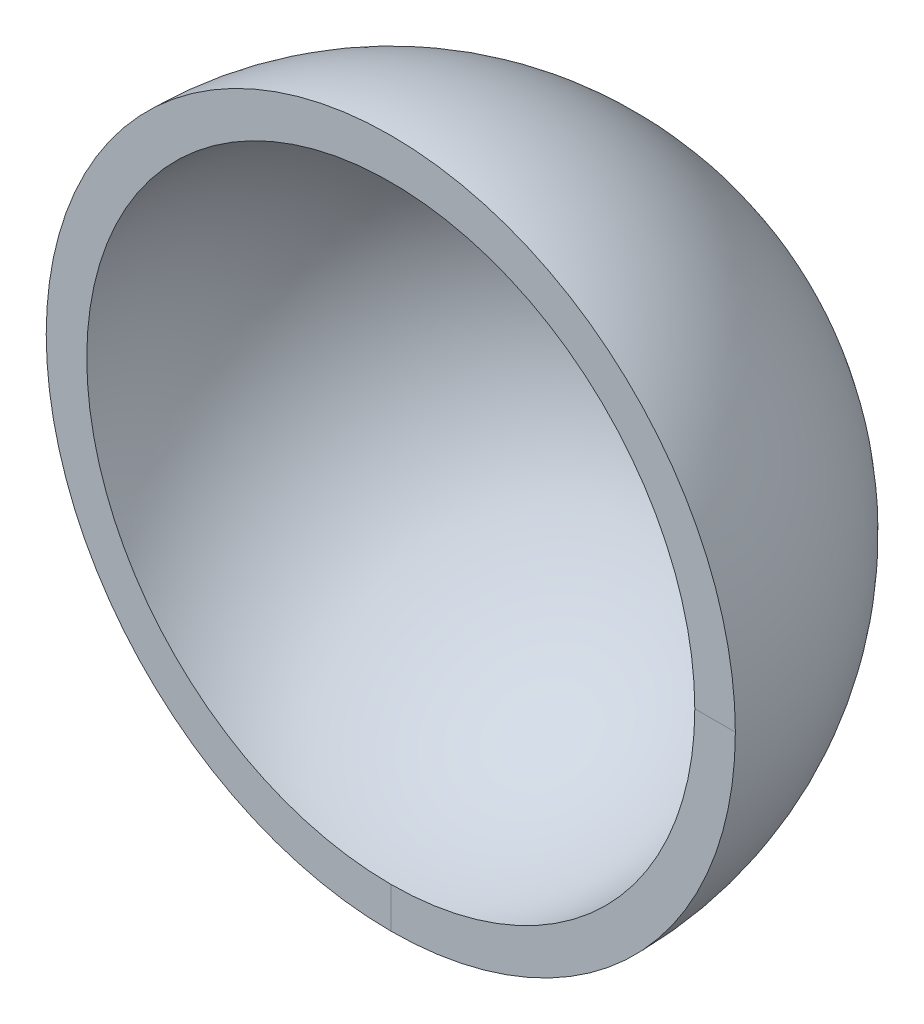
ISO-10303-21;
HEADER;
FILE_DESCRIPTION(('STEP AP214'),'2;1');
FILE_NAME('part.step','',(''),(''),'','','');
FILE_SCHEMA(('AUTOMOTIVE_DESIGN { 1 0 10303 214 1 1 1 1 }'));
ENDSEC;
DATA;
#1=APPLICATION_CONTEXT('core data for automotive mechanical design processes');
#2=APPLICATION_PROTOCOL_DEFINITION('international standard','automotive_design',2000,#1);
#3=PRODUCT_CONTEXT('',#1,'mechanical');
#4=PRODUCT('Part','Part','',(#3));
#5=PRODUCT_RELATED_PRODUCT_CATEGORY('part','',(#4));
#6=PRODUCT_DEFINITION_FORMATION('','',#4);
#7=PRODUCT_DEFINITION_CONTEXT('part definition',#1,'design');
#8=PRODUCT_DEFINITION('design','',#6,#7);
#9=PRODUCT_DEFINITION_SHAPE('','',#8);
#10=(LENGTH_UNIT() NAMED_UNIT(*) SI_UNIT(.MILLI.,.METRE.));
#11=(NAMED_UNIT(*) PLANE_ANGLE_UNIT() SI_UNIT($,.RADIAN.));
#12=(NAMED_UNIT(*) SI_UNIT($,.STERADIAN.) SOLID_ANGLE_UNIT());
#13=UNCERTAINTY_MEASURE_WITH_UNIT(LENGTH_MEASURE(1.E-05),#10,'distance_accuracy_value','');
#14=(GEOMETRIC_REPRESENTATION_CONTEXT(3) GLOBAL_UNCERTAINTY_ASSIGNED_CONTEXT((#13)) GLOBAL_UNIT_ASSIGNED_CONTEXT((#10,
#11,#12)) REPRESENTATION_CONTEXT('',''));
#15=CARTESIAN_POINT('',(0.,0.,0.));
#16=DIRECTION('',(0.,0.,1.));
#17=DIRECTION('',(1.,0.,0.));
#18=AXIS2_PLACEMENT_3D('',#15,#16,#17);
#19=CARTESIAN_POINT('',(0.,21.59,0.));
#20=DIRECTION('',(0.,0.,-1.));
#21=DIRECTION('',(-1.,0.,0.));
#22=AXIS2_PLACEMENT_3D('',#19,#20,#21);
#23=PLANE('',#22);
#24=DIRECTION('',(0.,-1.,0.));
#25=VECTOR('',#24,1.);
#26=CARTESIAN_POINT('',(0.,21.59,0.));
#27=LINE('',#26,#25);
#28=CARTESIAN_POINT('',(0.,2.54,0.));
#29=VERTEX_POINT('',#28);
#30=CARTESIAN_POINT('',(0.,0.,0.));
#31=VERTEX_POINT('',#30);
#32=EDGE_CURVE('E11',#29,#31,#27,.T.);
#33=ORIENTED_EDGE('',*,*,#32,.F.);
#34=CARTESIAN_POINT('',(0.,21.59,0.));
#35=DIRECTION('',(0.,0.,1.));
#36=DIRECTION('',(-1.,0.,0.));
#37=AXIS2_PLACEMENT_3D('',#34,#35,#36);
#38=CIRCLE('',#37,19.05);
#39=CARTESIAN_POINT('',(19.05,21.59,-1.33025439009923E-13));
#40=VERTEX_POINT('',#39);
#41=EDGE_CURVE('E60',#40,#29,#38,.T.);
#42=ORIENTED_EDGE('',*,*,#41,.F.);
#43=DIRECTION('',(-1.,0.,0.));
#44=VECTOR('',#43,1.);
#45=CARTESIAN_POINT('',(0.,21.59,0.));
#46=LINE('',#45,#44);
#47=CARTESIAN_POINT('',(21.59,21.59,-1.50762164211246E-13));
#48=VERTEX_POINT('',#47);
#49=EDGE_CURVE('E43',#48,#40,#46,.T.);
#50=ORIENTED_EDGE('',*,*,#49,.F.);
#51=CARTESIAN_POINT('',(0.,21.59,0.));
#52=DIRECTION('',(0.,0.,-1.));
#53=DIRECTION('',(-1.,0.,0.));
#54=AXIS2_PLACEMENT_3D('',#51,#52,#53);
#55=CIRCLE('',#54,21.59);
#56=EDGE_CURVE('E62',#31,#48,#55,.T.);
#57=ORIENTED_EDGE('',*,*,#56,.F.);
#58=EDGE_LOOP('',(#33,#42,#50,#57));
#59=FACE_BOUND('',#58,.T.);
#60=ADVANCED_FACE('F34',(#59),#23,.F.);
#61=CARTESIAN_POINT('',(0.,21.59,0.));
#62=DIRECTION('',(0.,-1.,0.));
#63=DIRECTION('',(1.,0.,0.));
#64=AXIS2_PLACEMENT_3D('',#61,#62,#63);
#65=SPHERICAL_SURFACE('',#64,21.59);
#66=CARTESIAN_POINT('',(0.,21.59,0.));
#67=DIRECTION('',(0.,0.,-1.));
#68=DIRECTION('',(-1.,0.,0.));
#69=AXIS2_PLACEMENT_3D('',#66,#67,#68);
#70=SPHERICAL_SURFACE('',#69,21.59);
#71=EDGE_CURVE('E66',#48,#31,#55,.T.);
#72=ORIENTED_EDGE('',*,*,#71,.T.);
#73=ORIENTED_EDGE('',*,*,#56,.T.);
#74=EDGE_LOOP('',(#72,#73));
#75=FACE_BOUND('',#74,.T.);
#76=ADVANCED_FACE('F72',(#75),#70,.T.);
#77=CARTESIAN_POINT('',(0.,21.59,0.));
#78=DIRECTION('',(0.,-1.,0.));
#79=DIRECTION('',(1.,0.,0.));
#80=AXIS2_PLACEMENT_3D('',#77,#78,#79);
#81=SPHERICAL_SURFACE('',#80,19.05);
#82=CARTESIAN_POINT('',(0.,21.59,0.));
#83=DIRECTION('',(0.,0.,1.));
#84=DIRECTION('',(-1.,0.,0.));
#85=AXIS2_PLACEMENT_3D('',#82,#83,#84);
#86=SPHERICAL_SURFACE('',#85,19.05);
#87=EDGE_CURVE('E65',#29,#40,#38,.T.);
#88=ORIENTED_EDGE('',*,*,#87,.T.);
#89=ORIENTED_EDGE('',*,*,#41,.T.);
#90=EDGE_LOOP('',(#88,#89));
#91=FACE_BOUND('',#90,.T.);
#92=ADVANCED_FACE('F36',(#91),#86,.F.);
#93=ORIENTED_EDGE('',*,*,#87,.F.);
#94=ORIENTED_EDGE('',*,*,#32,.T.);
#95=ORIENTED_EDGE('',*,*,#71,.F.);
#96=ORIENTED_EDGE('',*,*,#49,.T.);
#97=EDGE_LOOP('',(#93,#94,#95,#96));
#98=FACE_BOUND('',#97,.T.);
#99=ADVANCED_FACE('F68',(#98),#23,.F.);
#100=CLOSED_SHELL('',(#60,#76,#92,#99));
#101=MANIFOLD_SOLID_BREP('B2',#100);
#102=ADVANCED_BREP_SHAPE_REPRESENTATION('',(#18,#101),#14);
#103=SHAPE_DEFINITION_REPRESENTATION(#9,#102);
ENDSEC;
END-ISO-10303-21;
